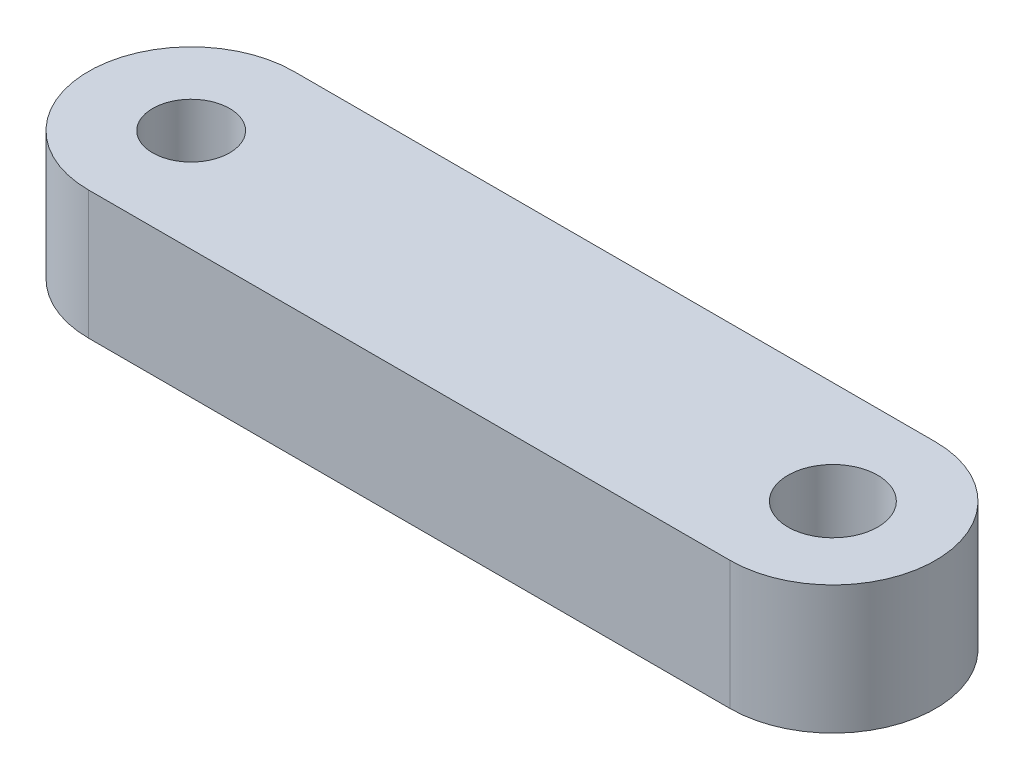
ISO-10303-21;
HEADER;
FILE_DESCRIPTION(('STEP AP214'),'2;1');
FILE_NAME('part.step','',(''),(''),'','','');
FILE_SCHEMA(('AUTOMOTIVE_DESIGN { 1 0 10303 214 1 1 1 1 }'));
ENDSEC;
DATA;
#1=APPLICATION_CONTEXT('core data for automotive mechanical design processes');
#2=APPLICATION_PROTOCOL_DEFINITION('international standard','automotive_design',2000,#1);
#3=PRODUCT_CONTEXT('',#1,'mechanical');
#4=PRODUCT('Part','Part','',(#3));
#5=PRODUCT_RELATED_PRODUCT_CATEGORY('part','',(#4));
#6=PRODUCT_DEFINITION_FORMATION('','',#4);
#7=PRODUCT_DEFINITION_CONTEXT('part definition',#1,'design');
#8=PRODUCT_DEFINITION('design','',#6,#7);
#9=PRODUCT_DEFINITION_SHAPE('','',#8);
#10=(LENGTH_UNIT() NAMED_UNIT(*) SI_UNIT(.MILLI.,.METRE.));
#11=(NAMED_UNIT(*) PLANE_ANGLE_UNIT() SI_UNIT($,.RADIAN.));
#12=(NAMED_UNIT(*) SI_UNIT($,.STERADIAN.) SOLID_ANGLE_UNIT());
#13=UNCERTAINTY_MEASURE_WITH_UNIT(LENGTH_MEASURE(1.E-05),#10,'distance_accuracy_value','');
#14=(GEOMETRIC_REPRESENTATION_CONTEXT(3) GLOBAL_UNCERTAINTY_ASSIGNED_CONTEXT((#13)) GLOBAL_UNIT_ASSIGNED_CONTEXT((#10,
#11,#12)) REPRESENTATION_CONTEXT('',''));
#15=CARTESIAN_POINT('',(0.,0.,0.));
#16=DIRECTION('',(0.,0.,1.));
#17=DIRECTION('',(1.,0.,0.));
#18=AXIS2_PLACEMENT_3D('',#15,#16,#17);
#19=CARTESIAN_POINT('',(0.,10.,0.));
#20=DIRECTION('',(0.,1.,0.));
#21=DIRECTION('',(0.,0.,1.));
#22=AXIS2_PLACEMENT_3D('',#19,#20,#21);
#23=PLANE('',#22);
#24=CARTESIAN_POINT('',(50.,10.,0.));
#25=DIRECTION('',(0.,1.,0.));
#26=DIRECTION('',(0.,0.,1.));
#27=AXIS2_PLACEMENT_3D('',#24,#25,#26);
#28=CIRCLE('',#27,3.5);
#29=CARTESIAN_POINT('',(50.,10.,3.5));
#30=VERTEX_POINT('',#29);
#31=EDGE_CURVE('E112',#30,#30,#28,.T.);
#32=ORIENTED_EDGE('',*,*,#31,.F.);
#33=EDGE_LOOP('',(#32));
#34=FACE_BOUND('',#33,.T.);
#35=CARTESIAN_POINT('',(0.,10.,0.));
#36=DIRECTION('',(0.,1.,0.));
#37=DIRECTION('',(0.,0.,1.));
#38=AXIS2_PLACEMENT_3D('',#35,#36,#37);
#39=CIRCLE('',#38,8.);
#40=CARTESIAN_POINT('',(0.,10.,-8.));
#41=VERTEX_POINT('',#40);
#42=CARTESIAN_POINT('',(0.,10.,8.));
#43=VERTEX_POINT('',#42);
#44=EDGE_CURVE('E92',#41,#43,#39,.T.);
#45=ORIENTED_EDGE('',*,*,#44,.T.);
#46=DIRECTION('',(1.,0.,0.));
#47=VECTOR('',#46,1.);
#48=CARTESIAN_POINT('',(0.,10.,8.));
#49=LINE('',#48,#47);
#50=CARTESIAN_POINT('',(50.,10.,8.));
#51=VERTEX_POINT('',#50);
#52=EDGE_CURVE('E87',#43,#51,#49,.T.);
#53=ORIENTED_EDGE('',*,*,#52,.T.);
#54=CARTESIAN_POINT('',(50.,10.,0.));
#55=DIRECTION('',(0.,1.,0.));
#56=DIRECTION('',(0.,0.,1.));
#57=AXIS2_PLACEMENT_3D('',#54,#55,#56);
#58=CIRCLE('',#57,8.);
#59=CARTESIAN_POINT('',(50.,10.,-8.));
#60=VERTEX_POINT('',#59);
#61=EDGE_CURVE('E90',#51,#60,#58,.T.);
#62=ORIENTED_EDGE('',*,*,#61,.T.);
#63=DIRECTION('',(-1.,0.,0.));
#64=VECTOR('',#63,1.);
#65=CARTESIAN_POINT('',(0.,10.,-8.));
#66=LINE('',#65,#64);
#67=EDGE_CURVE('E57',#60,#41,#66,.T.);
#68=ORIENTED_EDGE('',*,*,#67,.T.);
#69=EDGE_LOOP('',(#45,#53,#62,#68));
#70=FACE_BOUND('',#69,.T.);
#71=CARTESIAN_POINT('',(0.,10.,0.));
#72=DIRECTION('',(0.,1.,0.));
#73=DIRECTION('',(0.,0.,1.));
#74=AXIS2_PLACEMENT_3D('',#71,#72,#73);
#75=CIRCLE('',#74,3.);
#76=CARTESIAN_POINT('',(0.,10.,3.));
#77=VERTEX_POINT('',#76);
#78=EDGE_CURVE('E134',#77,#77,#75,.T.);
#79=ORIENTED_EDGE('',*,*,#78,.F.);
#80=EDGE_LOOP('',(#79));
#81=FACE_BOUND('',#80,.T.);
#82=ADVANCED_FACE('F39',(#34,#70,#81),#23,.T.);
#83=CARTESIAN_POINT('',(0.,0.,0.));
#84=DIRECTION('',(0.,1.,0.));
#85=DIRECTION('',(0.,0.,1.));
#86=AXIS2_PLACEMENT_3D('',#83,#84,#85);
#87=PLANE('',#86);
#88=CARTESIAN_POINT('',(0.,0.,0.));
#89=DIRECTION('',(0.,1.,0.));
#90=DIRECTION('',(0.,0.,1.));
#91=AXIS2_PLACEMENT_3D('',#88,#89,#90);
#92=CIRCLE('',#91,8.);
#93=CARTESIAN_POINT('',(0.,0.,-8.));
#94=VERTEX_POINT('',#93);
#95=CARTESIAN_POINT('',(0.,0.,8.));
#96=VERTEX_POINT('',#95);
#97=EDGE_CURVE('E108',#94,#96,#92,.T.);
#98=ORIENTED_EDGE('',*,*,#97,.F.);
#99=DIRECTION('',(-1.,0.,0.));
#100=VECTOR('',#99,1.);
#101=CARTESIAN_POINT('',(0.,0.,-8.));
#102=LINE('',#101,#100);
#103=CARTESIAN_POINT('',(50.,0.,-8.));
#104=VERTEX_POINT('',#103);
#105=EDGE_CURVE('E80',#104,#94,#102,.T.);
#106=ORIENTED_EDGE('',*,*,#105,.F.);
#107=CARTESIAN_POINT('',(50.,0.,0.));
#108=DIRECTION('',(0.,1.,0.));
#109=DIRECTION('',(0.,0.,1.));
#110=AXIS2_PLACEMENT_3D('',#107,#108,#109);
#111=CIRCLE('',#110,8.);
#112=CARTESIAN_POINT('',(50.,0.,8.));
#113=VERTEX_POINT('',#112);
#114=EDGE_CURVE('E74',#113,#104,#111,.T.);
#115=ORIENTED_EDGE('',*,*,#114,.F.);
#116=DIRECTION('',(1.,0.,0.));
#117=VECTOR('',#116,1.);
#118=CARTESIAN_POINT('',(0.,0.,8.));
#119=LINE('',#118,#117);
#120=EDGE_CURVE('E97',#96,#113,#119,.T.);
#121=ORIENTED_EDGE('',*,*,#120,.F.);
#122=EDGE_LOOP('',(#98,#106,#115,#121));
#123=FACE_BOUND('',#122,.T.);
#124=CARTESIAN_POINT('',(50.,0.,0.));
#125=DIRECTION('',(0.,1.,0.));
#126=DIRECTION('',(0.,0.,1.));
#127=AXIS2_PLACEMENT_3D('',#124,#125,#126);
#128=CIRCLE('',#127,3.5);
#129=CARTESIAN_POINT('',(50.,0.,3.5));
#130=VERTEX_POINT('',#129);
#131=EDGE_CURVE('E130',#130,#130,#128,.T.);
#132=ORIENTED_EDGE('',*,*,#131,.T.);
#133=EDGE_LOOP('',(#132));
#134=FACE_BOUND('',#133,.T.);
#135=CARTESIAN_POINT('',(0.,0.,0.));
#136=DIRECTION('',(0.,1.,0.));
#137=DIRECTION('',(0.,0.,1.));
#138=AXIS2_PLACEMENT_3D('',#135,#136,#137);
#139=CIRCLE('',#138,3.);
#140=CARTESIAN_POINT('',(0.,0.,3.));
#141=VERTEX_POINT('',#140);
#142=EDGE_CURVE('E138',#141,#141,#139,.T.);
#143=ORIENTED_EDGE('',*,*,#142,.T.);
#144=EDGE_LOOP('',(#143));
#145=FACE_BOUND('',#144,.T.);
#146=ADVANCED_FACE('F125',(#123,#134,#145),#87,.F.);
#147=CARTESIAN_POINT('',(0.,10.,0.));
#148=DIRECTION('',(0.,-1.,0.));
#149=DIRECTION('',(0.,0.,-1.));
#150=AXIS2_PLACEMENT_3D('',#147,#148,#149);
#151=CYLINDRICAL_SURFACE('',#150,8.);
#152=ORIENTED_EDGE('',*,*,#97,.T.);
#153=DIRECTION('',(0.,-1.,0.));
#154=VECTOR('',#153,1.);
#155=CARTESIAN_POINT('',(0.,10.,8.));
#156=LINE('',#155,#154);
#157=EDGE_CURVE('E11',#43,#96,#156,.T.);
#158=ORIENTED_EDGE('',*,*,#157,.F.);
#159=ORIENTED_EDGE('',*,*,#44,.F.);
#160=DIRECTION('',(0.,-1.,0.));
#161=VECTOR('',#160,1.);
#162=CARTESIAN_POINT('',(0.,10.,-8.));
#163=LINE('',#162,#161);
#164=EDGE_CURVE('E104',#41,#94,#163,.T.);
#165=ORIENTED_EDGE('',*,*,#164,.T.);
#166=EDGE_LOOP('',(#152,#158,#159,#165));
#167=FACE_BOUND('',#166,.T.);
#168=ADVANCED_FACE('F41',(#167),#151,.T.);
#169=CARTESIAN_POINT('',(0.,10.,8.));
#170=DIRECTION('',(0.,0.,-1.));
#171=DIRECTION('',(-1.,0.,0.));
#172=AXIS2_PLACEMENT_3D('',#169,#170,#171);
#173=PLANE('',#172);
#174=ORIENTED_EDGE('',*,*,#120,.T.);
#175=DIRECTION('',(0.,-1.,0.));
#176=VECTOR('',#175,1.);
#177=CARTESIAN_POINT('',(50.,10.,8.));
#178=LINE('',#177,#176);
#179=EDGE_CURVE('E49',#51,#113,#178,.T.);
#180=ORIENTED_EDGE('',*,*,#179,.F.);
#181=ORIENTED_EDGE('',*,*,#52,.F.);
#182=ORIENTED_EDGE('',*,*,#157,.T.);
#183=EDGE_LOOP('',(#174,#180,#181,#182));
#184=FACE_BOUND('',#183,.T.);
#185=ADVANCED_FACE('F96',(#184),#173,.F.);
#186=CARTESIAN_POINT('',(50.,10.,0.));
#187=DIRECTION('',(0.,-1.,0.));
#188=DIRECTION('',(0.,0.,-1.));
#189=AXIS2_PLACEMENT_3D('',#186,#187,#188);
#190=CYLINDRICAL_SURFACE('',#189,8.);
#191=ORIENTED_EDGE('',*,*,#114,.T.);
#192=DIRECTION('',(0.,-1.,0.));
#193=VECTOR('',#192,1.);
#194=CARTESIAN_POINT('',(50.,10.,-8.));
#195=LINE('',#194,#193);
#196=EDGE_CURVE('E99',#60,#104,#195,.T.);
#197=ORIENTED_EDGE('',*,*,#196,.F.);
#198=ORIENTED_EDGE('',*,*,#61,.F.);
#199=ORIENTED_EDGE('',*,*,#179,.T.);
#200=EDGE_LOOP('',(#191,#197,#198,#199));
#201=FACE_BOUND('',#200,.T.);
#202=ADVANCED_FACE('F100',(#201),#190,.T.);
#203=CARTESIAN_POINT('',(0.,10.,-8.));
#204=DIRECTION('',(0.,0.,1.));
#205=DIRECTION('',(1.,0.,0.));
#206=AXIS2_PLACEMENT_3D('',#203,#204,#205);
#207=PLANE('',#206);
#208=ORIENTED_EDGE('',*,*,#105,.T.);
#209=ORIENTED_EDGE('',*,*,#164,.F.);
#210=ORIENTED_EDGE('',*,*,#67,.F.);
#211=ORIENTED_EDGE('',*,*,#196,.T.);
#212=EDGE_LOOP('',(#208,#209,#210,#211));
#213=FACE_BOUND('',#212,.T.);
#214=ADVANCED_FACE('F122',(#213),#207,.F.);
#215=CARTESIAN_POINT('',(50.,10.,0.));
#216=DIRECTION('',(0.,-1.,0.));
#217=DIRECTION('',(0.,0.,-1.));
#218=AXIS2_PLACEMENT_3D('',#215,#216,#217);
#219=CYLINDRICAL_SURFACE('',#218,3.5);
#220=ORIENTED_EDGE('',*,*,#31,.T.);
#221=EDGE_LOOP('',(#220));
#222=FACE_BOUND('',#221,.T.);
#223=ORIENTED_EDGE('',*,*,#131,.F.);
#224=EDGE_LOOP('',(#223));
#225=FACE_BOUND('',#224,.T.);
#226=ADVANCED_FACE('F157',(#222,#225),#219,.F.);
#227=CARTESIAN_POINT('',(0.,10.,0.));
#228=DIRECTION('',(0.,-1.,0.));
#229=DIRECTION('',(0.,0.,-1.));
#230=AXIS2_PLACEMENT_3D('',#227,#228,#229);
#231=CYLINDRICAL_SURFACE('',#230,3.);
#232=ORIENTED_EDGE('',*,*,#78,.T.);
#233=EDGE_LOOP('',(#232));
#234=FACE_BOUND('',#233,.T.);
#235=ORIENTED_EDGE('',*,*,#142,.F.);
#236=EDGE_LOOP('',(#235));
#237=FACE_BOUND('',#236,.T.);
#238=ADVANCED_FACE('F146',(#234,#237),#231,.F.);
#239=CLOSED_SHELL('',(#82,#146,#168,#185,#202,#214,#226,#238));
#240=MANIFOLD_SOLID_BREP('B2',#239);
#241=ADVANCED_BREP_SHAPE_REPRESENTATION('',(#18,#240),#14);
#242=SHAPE_DEFINITION_REPRESENTATION(#9,#241);
ENDSEC;
END-ISO-10303-21;
